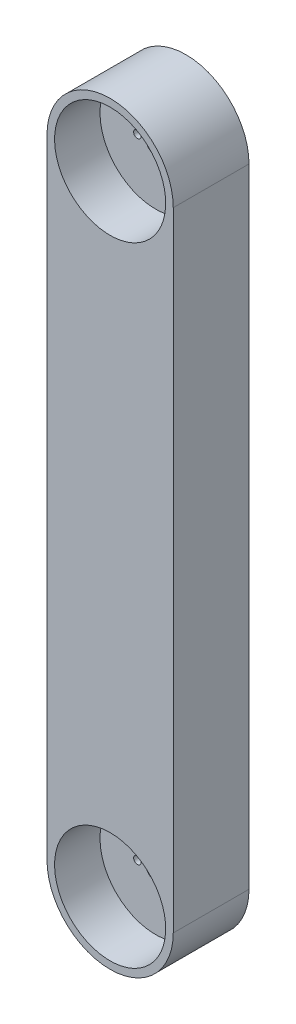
ISO-10303-21;
HEADER;
FILE_DESCRIPTION(('STEP AP214'),'2;1');
FILE_NAME('part.step','',(''),(''),'','','');
FILE_SCHEMA(('AUTOMOTIVE_DESIGN { 1 0 10303 214 1 1 1 1 }'));
ENDSEC;
DATA;
#1=APPLICATION_CONTEXT('core data for automotive mechanical design processes');
#2=APPLICATION_PROTOCOL_DEFINITION('international standard','automotive_design',2000,#1);
#3=PRODUCT_CONTEXT('',#1,'mechanical');
#4=PRODUCT('Part','Part','',(#3));
#5=PRODUCT_RELATED_PRODUCT_CATEGORY('part','',(#4));
#6=PRODUCT_DEFINITION_FORMATION('','',#4);
#7=PRODUCT_DEFINITION_CONTEXT('part definition',#1,'design');
#8=PRODUCT_DEFINITION('design','',#6,#7);
#9=PRODUCT_DEFINITION_SHAPE('','',#8);
#10=(LENGTH_UNIT() NAMED_UNIT(*) SI_UNIT(.MILLI.,.METRE.));
#11=(NAMED_UNIT(*) PLANE_ANGLE_UNIT() SI_UNIT($,.RADIAN.));
#12=(NAMED_UNIT(*) SI_UNIT($,.STERADIAN.) SOLID_ANGLE_UNIT());
#13=UNCERTAINTY_MEASURE_WITH_UNIT(LENGTH_MEASURE(1.E-05),#10,'distance_accuracy_value','');
#14=(GEOMETRIC_REPRESENTATION_CONTEXT(3) GLOBAL_UNCERTAINTY_ASSIGNED_CONTEXT((#13)) GLOBAL_UNIT_ASSIGNED_CONTEXT((#10,
#11,#12)) REPRESENTATION_CONTEXT('',''));
#15=CARTESIAN_POINT('',(0.,0.,0.));
#16=DIRECTION('',(0.,0.,1.));
#17=DIRECTION('',(1.,0.,0.));
#18=AXIS2_PLACEMENT_3D('',#15,#16,#17);
#19=CARTESIAN_POINT('',(0.,28.3690413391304,12.));
#20=DIRECTION('',(0.,0.,1.));
#21=DIRECTION('',(1.,0.,0.));
#22=AXIS2_PLACEMENT_3D('',#19,#20,#21);
#23=CYLINDRICAL_SURFACE('',#22,22.);
#24=CARTESIAN_POINT('',(0.,28.3690413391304,30.));
#25=DIRECTION('',(0.,0.,-1.));
#26=DIRECTION('',(0.,1.,0.));
#27=AXIS2_PLACEMENT_3D('',#24,#25,#26);
#28=CIRCLE('',#27,22.);
#29=CARTESIAN_POINT('',(0.,50.3690413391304,30.));
#30=VERTEX_POINT('',#29);
#31=EDGE_CURVE('E161',#30,#30,#28,.T.);
#32=ORIENTED_EDGE('',*,*,#31,.F.);
#33=EDGE_LOOP('',(#32));
#34=FACE_BOUND('',#33,.T.);
#35=CARTESIAN_POINT('',(0.,28.3690413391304,12.));
#36=DIRECTION('',(0.,0.,-1.));
#37=DIRECTION('',(0.,1.,0.));
#38=AXIS2_PLACEMENT_3D('',#35,#36,#37);
#39=CIRCLE('',#38,22.);
#40=CARTESIAN_POINT('',(0.,50.3690413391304,12.));
#41=VERTEX_POINT('',#40);
#42=EDGE_CURVE('E10',#41,#41,#39,.T.);
#43=ORIENTED_EDGE('',*,*,#42,.T.);
#44=EDGE_LOOP('',(#43));
#45=FACE_BOUND('',#44,.T.);
#46=ADVANCED_FACE('F16',(#34,#45),#23,.F.);
#47=CARTESIAN_POINT('',(0.,28.3690413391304,12.));
#48=DIRECTION('',(0.,0.,-1.));
#49=DIRECTION('',(0.,-1.,0.));
#50=AXIS2_PLACEMENT_3D('',#47,#48,#49);
#51=PLANE('',#50);
#52=CARTESIAN_POINT('',(0.,28.4431326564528,12.));
#53=DIRECTION('',(0.,0.,1.));
#54=DIRECTION('',(-1.,0.,0.));
#55=AXIS2_PLACEMENT_3D('',#52,#53,#54);
#56=CIRCLE('',#55,3.75);
#57=CARTESIAN_POINT('',(-3.75,28.4431326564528,12.));
#58=VERTEX_POINT('',#57);
#59=EDGE_CURVE('E210',#58,#58,#56,.T.);
#60=ORIENTED_EDGE('',*,*,#59,.F.);
#61=EDGE_LOOP('',(#60));
#62=FACE_BOUND('',#61,.T.);
#63=ORIENTED_EDGE('',*,*,#42,.F.);
#64=EDGE_LOOP('',(#63));
#65=FACE_BOUND('',#64,.T.);
#66=CARTESIAN_POINT('',(-7.2,28.4842972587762,12.));
#67=DIRECTION('',(0.,0.,-1.));
#68=DIRECTION('',(-1.,0.,0.));
#69=AXIS2_PLACEMENT_3D('',#66,#67,#68);
#70=CIRCLE('',#69,1.5);
#71=CARTESIAN_POINT('',(-8.7,28.4842972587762,12.));
#72=VERTEX_POINT('',#71);
#73=EDGE_CURVE('E219',#72,#72,#70,.T.);
#74=ORIENTED_EDGE('',*,*,#73,.T.);
#75=EDGE_LOOP('',(#74));
#76=FACE_BOUND('',#75,.T.);
#77=CARTESIAN_POINT('',(7.2,28.4842972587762,12.));
#78=DIRECTION('',(0.,0.,1.));
#79=DIRECTION('',(-1.,0.,0.));
#80=AXIS2_PLACEMENT_3D('',#77,#78,#79);
#81=CIRCLE('',#80,1.5);
#82=CARTESIAN_POINT('',(5.7,28.4842972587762,12.));
#83=VERTEX_POINT('',#82);
#84=EDGE_CURVE('E220',#83,#83,#81,.T.);
#85=ORIENTED_EDGE('',*,*,#84,.F.);
#86=EDGE_LOOP('',(#85));
#87=FACE_BOUND('',#86,.T.);
#88=ADVANCED_FACE('F298',(#62,#65,#76,#87),#51,.F.);
#89=CARTESIAN_POINT('',(0.,-220.429632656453,12.));
#90=DIRECTION('',(0.,0.,1.));
#91=DIRECTION('',(1.,0.,0.));
#92=AXIS2_PLACEMENT_3D('',#89,#90,#91);
#93=CYLINDRICAL_SURFACE('',#92,22.);
#94=CARTESIAN_POINT('',(0.,-220.429632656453,30.));
#95=DIRECTION('',(0.,0.,-1.));
#96=DIRECTION('',(0.,1.,0.));
#97=AXIS2_PLACEMENT_3D('',#94,#95,#96);
#98=CIRCLE('',#97,22.);
#99=CARTESIAN_POINT('',(0.,-198.429632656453,30.));
#100=VERTEX_POINT('',#99);
#101=EDGE_CURVE('E204',#100,#100,#98,.T.);
#102=ORIENTED_EDGE('',*,*,#101,.F.);
#103=EDGE_LOOP('',(#102));
#104=FACE_BOUND('',#103,.T.);
#105=CARTESIAN_POINT('',(0.,-220.429632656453,12.));
#106=DIRECTION('',(0.,0.,-1.));
#107=DIRECTION('',(0.,1.,0.));
#108=AXIS2_PLACEMENT_3D('',#105,#106,#107);
#109=CIRCLE('',#108,22.);
#110=CARTESIAN_POINT('',(0.,-198.429632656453,12.));
#111=VERTEX_POINT('',#110);
#112=EDGE_CURVE('E27',#111,#111,#109,.T.);
#113=ORIENTED_EDGE('',*,*,#112,.T.);
#114=EDGE_LOOP('',(#113));
#115=FACE_BOUND('',#114,.T.);
#116=ADVANCED_FACE('F256',(#104,#115),#93,.F.);
#117=CARTESIAN_POINT('',(0.,-220.429632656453,12.));
#118=DIRECTION('',(0.,0.,-1.));
#119=DIRECTION('',(0.,-1.,0.));
#120=AXIS2_PLACEMENT_3D('',#117,#118,#119);
#121=PLANE('',#120);
#122=CARTESIAN_POINT('',(-7.2,-220.470797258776,12.));
#123=DIRECTION('',(0.,0.,1.));
#124=DIRECTION('',(-1.,0.,0.));
#125=AXIS2_PLACEMENT_3D('',#122,#123,#124);
#126=CIRCLE('',#125,1.5);
#127=CARTESIAN_POINT('',(-8.7,-220.470797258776,12.));
#128=VERTEX_POINT('',#127);
#129=EDGE_CURVE('E235',#128,#128,#126,.T.);
#130=ORIENTED_EDGE('',*,*,#129,.F.);
#131=EDGE_LOOP('',(#130));
#132=FACE_BOUND('',#131,.T.);
#133=ORIENTED_EDGE('',*,*,#112,.F.);
#134=EDGE_LOOP('',(#133));
#135=FACE_BOUND('',#134,.T.);
#136=CARTESIAN_POINT('',(7.2,-220.470797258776,12.));
#137=DIRECTION('',(0.,0.,-1.));
#138=DIRECTION('',(-1.,0.,0.));
#139=AXIS2_PLACEMENT_3D('',#136,#137,#138);
#140=CIRCLE('',#139,1.5);
#141=CARTESIAN_POINT('',(5.7,-220.470797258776,12.));
#142=VERTEX_POINT('',#141);
#143=EDGE_CURVE('E199',#142,#142,#140,.T.);
#144=ORIENTED_EDGE('',*,*,#143,.T.);
#145=EDGE_LOOP('',(#144));
#146=FACE_BOUND('',#145,.T.);
#147=CARTESIAN_POINT('',(0.,-220.429632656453,12.));
#148=DIRECTION('',(0.,0.,-1.));
#149=DIRECTION('',(-1.,0.,0.));
#150=AXIS2_PLACEMENT_3D('',#147,#148,#149);
#151=CIRCLE('',#150,3.75);
#152=CARTESIAN_POINT('',(-3.75,-220.429632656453,12.));
#153=VERTEX_POINT('',#152);
#154=EDGE_CURVE('E227',#153,#153,#151,.T.);
#155=ORIENTED_EDGE('',*,*,#154,.T.);
#156=EDGE_LOOP('',(#155));
#157=FACE_BOUND('',#156,.T.);
#158=ADVANCED_FACE('F252',(#132,#135,#146,#157),#121,.F.);
#159=CARTESIAN_POINT('',(0.,28.4842972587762,6.));
#160=DIRECTION('',(0.,0.,-1.));
#161=DIRECTION('',(-1.,0.,0.));
#162=AXIS2_PLACEMENT_3D('',#159,#160,#161);
#163=CYLINDRICAL_SURFACE('',#162,12.5);
#164=CARTESIAN_POINT('',(0.,28.4842972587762,0.));
#165=DIRECTION('',(0.,0.,1.));
#166=DIRECTION('',(0.,1.,0.));
#167=AXIS2_PLACEMENT_3D('',#164,#165,#166);
#168=CIRCLE('',#167,12.5);
#169=CARTESIAN_POINT('',(0.,40.9842972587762,0.));
#170=VERTEX_POINT('',#169);
#171=EDGE_CURVE('E194',#170,#170,#168,.T.);
#172=ORIENTED_EDGE('',*,*,#171,.F.);
#173=EDGE_LOOP('',(#172));
#174=FACE_BOUND('',#173,.T.);
#175=CARTESIAN_POINT('',(0.,28.4842972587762,6.));
#176=DIRECTION('',(0.,0.,1.));
#177=DIRECTION('',(0.,1.,0.));
#178=AXIS2_PLACEMENT_3D('',#175,#176,#177);
#179=CIRCLE('',#178,12.5);
#180=CARTESIAN_POINT('',(0.,40.9842972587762,6.));
#181=VERTEX_POINT('',#180);
#182=EDGE_CURVE('E198',#181,#181,#179,.T.);
#183=ORIENTED_EDGE('',*,*,#182,.T.);
#184=EDGE_LOOP('',(#183));
#185=FACE_BOUND('',#184,.T.);
#186=ADVANCED_FACE('F255',(#174,#185),#163,.F.);
#187=CARTESIAN_POINT('',(0.,28.4842972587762,6.));
#188=DIRECTION('',(0.,0.,1.));
#189=DIRECTION('',(1.,0.,0.));
#190=AXIS2_PLACEMENT_3D('',#187,#188,#189);
#191=PLANE('',#190);
#192=CARTESIAN_POINT('',(0.,28.4431326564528,6.));
#193=DIRECTION('',(0.,0.,-1.));
#194=DIRECTION('',(1.,0.,0.));
#195=AXIS2_PLACEMENT_3D('',#192,#193,#194);
#196=CIRCLE('',#195,3.75);
#197=CARTESIAN_POINT('',(3.75,28.4431326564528,6.));
#198=VERTEX_POINT('',#197);
#199=EDGE_CURVE('E213',#198,#198,#196,.T.);
#200=ORIENTED_EDGE('',*,*,#199,.F.);
#201=EDGE_LOOP('',(#200));
#202=FACE_BOUND('',#201,.T.);
#203=ORIENTED_EDGE('',*,*,#182,.F.);
#204=EDGE_LOOP('',(#203));
#205=FACE_BOUND('',#204,.T.);
#206=CARTESIAN_POINT('',(-7.2,28.4842972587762,6.));
#207=DIRECTION('',(0.,0.,1.));
#208=DIRECTION('',(1.,0.,0.));
#209=AXIS2_PLACEMENT_3D('',#206,#207,#208);
#210=CIRCLE('',#209,1.5);
#211=CARTESIAN_POINT('',(-5.7,28.4842972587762,6.));
#212=VERTEX_POINT('',#211);
#213=EDGE_CURVE('E228',#212,#212,#210,.T.);
#214=ORIENTED_EDGE('',*,*,#213,.T.);
#215=EDGE_LOOP('',(#214));
#216=FACE_BOUND('',#215,.T.);
#217=CARTESIAN_POINT('',(7.2,28.4842972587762,6.));
#218=DIRECTION('',(0.,0.,-1.));
#219=DIRECTION('',(1.,0.,0.));
#220=AXIS2_PLACEMENT_3D('',#217,#218,#219);
#221=CIRCLE('',#220,1.5);
#222=CARTESIAN_POINT('',(8.7,28.4842972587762,6.));
#223=VERTEX_POINT('',#222);
#224=EDGE_CURVE('E215',#223,#223,#221,.T.);
#225=ORIENTED_EDGE('',*,*,#224,.F.);
#226=EDGE_LOOP('',(#225));
#227=FACE_BOUND('',#226,.T.);
#228=ADVANCED_FACE('F312',(#202,#205,#216,#227),#191,.F.);
#229=CARTESIAN_POINT('',(0.,-220.429632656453,6.));
#230=DIRECTION('',(0.,0.,-1.));
#231=DIRECTION('',(-1.,0.,0.));
#232=AXIS2_PLACEMENT_3D('',#229,#230,#231);
#233=CYLINDRICAL_SURFACE('',#232,12.5);
#234=CARTESIAN_POINT('',(0.,-220.429632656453,0.));
#235=DIRECTION('',(0.,0.,1.));
#236=DIRECTION('',(0.,1.,0.));
#237=AXIS2_PLACEMENT_3D('',#234,#235,#236);
#238=CIRCLE('',#237,12.5);
#239=CARTESIAN_POINT('',(0.,-207.929632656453,0.));
#240=VERTEX_POINT('',#239);
#241=EDGE_CURVE('E190',#240,#240,#238,.T.);
#242=ORIENTED_EDGE('',*,*,#241,.F.);
#243=EDGE_LOOP('',(#242));
#244=FACE_BOUND('',#243,.T.);
#245=CARTESIAN_POINT('',(0.,-220.429632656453,6.));
#246=DIRECTION('',(0.,0.,1.));
#247=DIRECTION('',(0.,1.,0.));
#248=AXIS2_PLACEMENT_3D('',#245,#246,#247);
#249=CIRCLE('',#248,12.5);
#250=CARTESIAN_POINT('',(0.,-207.929632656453,6.));
#251=VERTEX_POINT('',#250);
#252=EDGE_CURVE('E193',#251,#251,#249,.T.);
#253=ORIENTED_EDGE('',*,*,#252,.T.);
#254=EDGE_LOOP('',(#253));
#255=FACE_BOUND('',#254,.T.);
#256=ADVANCED_FACE('F309',(#244,#255),#233,.F.);
#257=CARTESIAN_POINT('',(0.,-220.429632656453,6.));
#258=DIRECTION('',(0.,0.,1.));
#259=DIRECTION('',(1.,0.,0.));
#260=AXIS2_PLACEMENT_3D('',#257,#258,#259);
#261=PLANE('',#260);
#262=CARTESIAN_POINT('',(-7.2,-220.470797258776,6.));
#263=DIRECTION('',(0.,0.,-1.));
#264=DIRECTION('',(1.,0.,0.));
#265=AXIS2_PLACEMENT_3D('',#262,#263,#264);
#266=CIRCLE('',#265,1.5);
#267=CARTESIAN_POINT('',(-5.7,-220.470797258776,6.));
#268=VERTEX_POINT('',#267);
#269=EDGE_CURVE('E137',#268,#268,#266,.T.);
#270=ORIENTED_EDGE('',*,*,#269,.F.);
#271=EDGE_LOOP('',(#270));
#272=FACE_BOUND('',#271,.T.);
#273=ORIENTED_EDGE('',*,*,#252,.F.);
#274=EDGE_LOOP('',(#273));
#275=FACE_BOUND('',#274,.T.);
#276=CARTESIAN_POINT('',(7.2,-220.470797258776,6.));
#277=DIRECTION('',(0.,0.,1.));
#278=DIRECTION('',(1.,0.,0.));
#279=AXIS2_PLACEMENT_3D('',#276,#277,#278);
#280=CIRCLE('',#279,1.5);
#281=CARTESIAN_POINT('',(8.7,-220.470797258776,6.));
#282=VERTEX_POINT('',#281);
#283=EDGE_CURVE('E201',#282,#282,#280,.T.);
#284=ORIENTED_EDGE('',*,*,#283,.T.);
#285=EDGE_LOOP('',(#284));
#286=FACE_BOUND('',#285,.T.);
#287=CARTESIAN_POINT('',(0.,-220.429632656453,6.));
#288=DIRECTION('',(0.,0.,1.));
#289=DIRECTION('',(1.,0.,0.));
#290=AXIS2_PLACEMENT_3D('',#287,#288,#289);
#291=CIRCLE('',#290,3.75);
#292=CARTESIAN_POINT('',(3.75,-220.429632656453,6.));
#293=VERTEX_POINT('',#292);
#294=EDGE_CURVE('E202',#293,#293,#291,.T.);
#295=ORIENTED_EDGE('',*,*,#294,.T.);
#296=EDGE_LOOP('',(#295));
#297=FACE_BOUND('',#296,.T.);
#298=ADVANCED_FACE('F242',(#272,#275,#286,#297),#261,.F.);
#299=CARTESIAN_POINT('',(0.,28.3690413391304,0.));
#300=DIRECTION('',(0.,0.,1.));
#301=DIRECTION('',(1.,0.,0.));
#302=AXIS2_PLACEMENT_3D('',#299,#300,#301);
#303=PLANE('',#302);
#304=CARTESIAN_POINT('',(0.,28.3690413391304,0.));
#305=DIRECTION('',(0.,0.,1.));
#306=DIRECTION('',(1.,0.,0.));
#307=AXIS2_PLACEMENT_3D('',#304,#305,#306);
#308=CIRCLE('',#307,25.);
#309=CARTESIAN_POINT('',(25.,28.3690413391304,0.));
#310=VERTEX_POINT('',#309);
#311=CARTESIAN_POINT('',(-25.,28.3690413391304,0.));
#312=VERTEX_POINT('',#311);
#313=EDGE_CURVE('E143',#310,#312,#308,.T.);
#314=ORIENTED_EDGE('',*,*,#313,.F.);
#315=DIRECTION('',(0.,1.,0.));
#316=VECTOR('',#315,1.);
#317=CARTESIAN_POINT('',(25.,28.3690413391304,0.));
#318=LINE('',#317,#316);
#319=CARTESIAN_POINT('',(25.,-220.35554133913,0.));
#320=VERTEX_POINT('',#319);
#321=EDGE_CURVE('E125',#320,#310,#318,.T.);
#322=ORIENTED_EDGE('',*,*,#321,.F.);
#323=CARTESIAN_POINT('',(0.,-220.35554133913,0.));
#324=DIRECTION('',(0.,0.,1.));
#325=DIRECTION('',(-1.,0.,0.));
#326=AXIS2_PLACEMENT_3D('',#323,#324,#325);
#327=CIRCLE('',#326,25.);
#328=CARTESIAN_POINT('',(-25.,-220.35554133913,0.));
#329=VERTEX_POINT('',#328);
#330=EDGE_CURVE('E168',#329,#320,#327,.T.);
#331=ORIENTED_EDGE('',*,*,#330,.F.);
#332=DIRECTION('',(0.,-1.,0.));
#333=VECTOR('',#332,1.);
#334=CARTESIAN_POINT('',(-25.,28.3690413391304,0.));
#335=LINE('',#334,#333);
#336=EDGE_CURVE('E20',#312,#329,#335,.T.);
#337=ORIENTED_EDGE('',*,*,#336,.F.);
#338=EDGE_LOOP('',(#314,#322,#331,#337));
#339=FACE_BOUND('',#338,.T.);
#340=ORIENTED_EDGE('',*,*,#241,.T.);
#341=EDGE_LOOP('',(#340));
#342=FACE_BOUND('',#341,.T.);
#343=ORIENTED_EDGE('',*,*,#171,.T.);
#344=EDGE_LOOP('',(#343));
#345=FACE_BOUND('',#344,.T.);
#346=ADVANCED_FACE('F147',(#339,#342,#345),#303,.F.);
#347=CARTESIAN_POINT('',(0.,28.3690413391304,30.));
#348=DIRECTION('',(0.,0.,1.));
#349=DIRECTION('',(1.,0.,0.));
#350=AXIS2_PLACEMENT_3D('',#347,#348,#349);
#351=PLANE('',#350);
#352=CARTESIAN_POINT('',(0.,28.3690413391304,30.));
#353=DIRECTION('',(0.,0.,1.));
#354=DIRECTION('',(1.,0.,0.));
#355=AXIS2_PLACEMENT_3D('',#352,#353,#354);
#356=CIRCLE('',#355,25.);
#357=CARTESIAN_POINT('',(25.,28.3690413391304,30.));
#358=VERTEX_POINT('',#357);
#359=CARTESIAN_POINT('',(-25.,28.3690413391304,30.));
#360=VERTEX_POINT('',#359);
#361=EDGE_CURVE('E145',#358,#360,#356,.T.);
#362=ORIENTED_EDGE('',*,*,#361,.T.);
#363=DIRECTION('',(0.,-1.,0.));
#364=VECTOR('',#363,1.);
#365=CARTESIAN_POINT('',(-25.,28.3690413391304,30.));
#366=LINE('',#365,#364);
#367=CARTESIAN_POINT('',(-25.,-220.35554133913,30.));
#368=VERTEX_POINT('',#367);
#369=EDGE_CURVE('E165',#360,#368,#366,.T.);
#370=ORIENTED_EDGE('',*,*,#369,.T.);
#371=CARTESIAN_POINT('',(0.,-220.35554133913,30.));
#372=DIRECTION('',(0.,0.,1.));
#373=DIRECTION('',(-1.,0.,0.));
#374=AXIS2_PLACEMENT_3D('',#371,#372,#373);
#375=CIRCLE('',#374,25.);
#376=CARTESIAN_POINT('',(25.,-220.35554133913,30.));
#377=VERTEX_POINT('',#376);
#378=EDGE_CURVE('E214',#368,#377,#375,.T.);
#379=ORIENTED_EDGE('',*,*,#378,.T.);
#380=DIRECTION('',(0.,1.,0.));
#381=VECTOR('',#380,1.);
#382=CARTESIAN_POINT('',(25.,28.3690413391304,30.));
#383=LINE('',#382,#381);
#384=EDGE_CURVE('E136',#377,#358,#383,.T.);
#385=ORIENTED_EDGE('',*,*,#384,.T.);
#386=EDGE_LOOP('',(#362,#370,#379,#385));
#387=FACE_BOUND('',#386,.T.);
#388=ORIENTED_EDGE('',*,*,#101,.T.);
#389=EDGE_LOOP('',(#388));
#390=FACE_BOUND('',#389,.T.);
#391=ORIENTED_EDGE('',*,*,#31,.T.);
#392=EDGE_LOOP('',(#391));
#393=FACE_BOUND('',#392,.T.);
#394=ADVANCED_FACE('F279',(#387,#390,#393),#351,.T.);
#395=CARTESIAN_POINT('',(25.,28.3690413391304,30.));
#396=DIRECTION('',(-1.,0.,0.));
#397=DIRECTION('',(0.,1.,0.));
#398=AXIS2_PLACEMENT_3D('',#395,#396,#397);
#399=PLANE('',#398);
#400=ORIENTED_EDGE('',*,*,#321,.T.);
#401=DIRECTION('',(0.,0.,-1.));
#402=VECTOR('',#401,1.);
#403=CARTESIAN_POINT('',(25.,28.3690413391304,30.));
#404=LINE('',#403,#402);
#405=EDGE_CURVE('E128',#358,#310,#404,.T.);
#406=ORIENTED_EDGE('',*,*,#405,.F.);
#407=ORIENTED_EDGE('',*,*,#384,.F.);
#408=DIRECTION('',(0.,0.,-1.));
#409=VECTOR('',#408,1.);
#410=CARTESIAN_POINT('',(25.,-220.35554133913,30.));
#411=LINE('',#410,#409);
#412=EDGE_CURVE('E131',#377,#320,#411,.T.);
#413=ORIENTED_EDGE('',*,*,#412,.T.);
#414=EDGE_LOOP('',(#400,#406,#407,#413));
#415=FACE_BOUND('',#414,.T.);
#416=ADVANCED_FACE('F127',(#415),#399,.F.);
#417=CARTESIAN_POINT('',(-7.2,-220.470797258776,30.));
#418=DIRECTION('',(0.,0.,-1.));
#419=DIRECTION('',(-1.,0.,0.));
#420=AXIS2_PLACEMENT_3D('',#417,#418,#419);
#421=CYLINDRICAL_SURFACE('',#420,1.5);
#422=ORIENTED_EDGE('',*,*,#269,.T.);
#423=EDGE_LOOP('',(#422));
#424=FACE_BOUND('',#423,.T.);
#425=ORIENTED_EDGE('',*,*,#129,.T.);
#426=EDGE_LOOP('',(#425));
#427=FACE_BOUND('',#426,.T.);
#428=ADVANCED_FACE('F18',(#424,#427),#421,.F.);
#429=CARTESIAN_POINT('',(7.2,-220.470797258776,30.));
#430=DIRECTION('',(0.,0.,-1.));
#431=DIRECTION('',(-1.,0.,0.));
#432=AXIS2_PLACEMENT_3D('',#429,#430,#431);
#433=CYLINDRICAL_SURFACE('',#432,1.5);
#434=ORIENTED_EDGE('',*,*,#283,.F.);
#435=EDGE_LOOP('',(#434));
#436=FACE_BOUND('',#435,.T.);
#437=ORIENTED_EDGE('',*,*,#143,.F.);
#438=EDGE_LOOP('',(#437));
#439=FACE_BOUND('',#438,.T.);
#440=ADVANCED_FACE('F245',(#436,#439),#433,.F.);
#441=CARTESIAN_POINT('',(0.,-220.429632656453,30.));
#442=DIRECTION('',(0.,0.,-1.));
#443=DIRECTION('',(-1.,0.,0.));
#444=AXIS2_PLACEMENT_3D('',#441,#442,#443);
#445=CYLINDRICAL_SURFACE('',#444,3.75);
#446=ORIENTED_EDGE('',*,*,#294,.F.);
#447=EDGE_LOOP('',(#446));
#448=FACE_BOUND('',#447,.T.);
#449=ORIENTED_EDGE('',*,*,#154,.F.);
#450=EDGE_LOOP('',(#449));
#451=FACE_BOUND('',#450,.T.);
#452=ADVANCED_FACE('F248',(#448,#451),#445,.F.);
#453=CARTESIAN_POINT('',(-7.2,28.4842972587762,30.));
#454=DIRECTION('',(0.,0.,-1.));
#455=DIRECTION('',(-1.,0.,0.));
#456=AXIS2_PLACEMENT_3D('',#453,#454,#455);
#457=CYLINDRICAL_SURFACE('',#456,1.5);
#458=ORIENTED_EDGE('',*,*,#213,.F.);
#459=EDGE_LOOP('',(#458));
#460=FACE_BOUND('',#459,.T.);
#461=ORIENTED_EDGE('',*,*,#73,.F.);
#462=EDGE_LOOP('',(#461));
#463=FACE_BOUND('',#462,.T.);
#464=ADVANCED_FACE('F332',(#460,#463),#457,.F.);
#465=CARTESIAN_POINT('',(7.2,28.4842972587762,30.));
#466=DIRECTION('',(0.,0.,-1.));
#467=DIRECTION('',(-1.,0.,0.));
#468=AXIS2_PLACEMENT_3D('',#465,#466,#467);
#469=CYLINDRICAL_SURFACE('',#468,1.5);
#470=ORIENTED_EDGE('',*,*,#224,.T.);
#471=EDGE_LOOP('',(#470));
#472=FACE_BOUND('',#471,.T.);
#473=ORIENTED_EDGE('',*,*,#84,.T.);
#474=EDGE_LOOP('',(#473));
#475=FACE_BOUND('',#474,.T.);
#476=ADVANCED_FACE('F293',(#472,#475),#469,.F.);
#477=CARTESIAN_POINT('',(0.,28.4431326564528,30.));
#478=DIRECTION('',(0.,0.,-1.));
#479=DIRECTION('',(-1.,0.,0.));
#480=AXIS2_PLACEMENT_3D('',#477,#478,#479);
#481=CYLINDRICAL_SURFACE('',#480,3.75);
#482=ORIENTED_EDGE('',*,*,#199,.T.);
#483=EDGE_LOOP('',(#482));
#484=FACE_BOUND('',#483,.T.);
#485=ORIENTED_EDGE('',*,*,#59,.T.);
#486=EDGE_LOOP('',(#485));
#487=FACE_BOUND('',#486,.T.);
#488=ADVANCED_FACE('F284',(#484,#487),#481,.F.);
#489=CARTESIAN_POINT('',(0.,-220.35554133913,30.));
#490=DIRECTION('',(0.,0.,-1.));
#491=DIRECTION('',(-1.,0.,0.));
#492=AXIS2_PLACEMENT_3D('',#489,#490,#491);
#493=CYLINDRICAL_SURFACE('',#492,25.);
#494=ORIENTED_EDGE('',*,*,#330,.T.);
#495=ORIENTED_EDGE('',*,*,#412,.F.);
#496=ORIENTED_EDGE('',*,*,#378,.F.);
#497=DIRECTION('',(0.,0.,-1.));
#498=VECTOR('',#497,1.);
#499=CARTESIAN_POINT('',(-25.,-220.35554133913,30.));
#500=LINE('',#499,#498);
#501=EDGE_CURVE('E169',#368,#329,#500,.T.);
#502=ORIENTED_EDGE('',*,*,#501,.T.);
#503=EDGE_LOOP('',(#494,#495,#496,#502));
#504=FACE_BOUND('',#503,.T.);
#505=ADVANCED_FACE('F281',(#504),#493,.T.);
#506=CARTESIAN_POINT('',(-25.,28.3690413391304,30.));
#507=DIRECTION('',(1.,0.,0.));
#508=DIRECTION('',(0.,1.,0.));
#509=AXIS2_PLACEMENT_3D('',#506,#507,#508);
#510=PLANE('',#509);
#511=ORIENTED_EDGE('',*,*,#336,.T.);
#512=ORIENTED_EDGE('',*,*,#501,.F.);
#513=ORIENTED_EDGE('',*,*,#369,.F.);
#514=DIRECTION('',(0.,0.,-1.));
#515=VECTOR('',#514,1.);
#516=CARTESIAN_POINT('',(-25.,28.3690413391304,30.));
#517=LINE('',#516,#515);
#518=EDGE_CURVE('E152',#360,#312,#517,.T.);
#519=ORIENTED_EDGE('',*,*,#518,.T.);
#520=EDGE_LOOP('',(#511,#512,#513,#519));
#521=FACE_BOUND('',#520,.T.);
#522=ADVANCED_FACE('F283',(#521),#510,.F.);
#523=CARTESIAN_POINT('',(0.,28.3690413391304,30.));
#524=DIRECTION('',(0.,0.,-1.));
#525=DIRECTION('',(-1.,0.,0.));
#526=AXIS2_PLACEMENT_3D('',#523,#524,#525);
#527=CYLINDRICAL_SURFACE('',#526,25.);
#528=ORIENTED_EDGE('',*,*,#313,.T.);
#529=ORIENTED_EDGE('',*,*,#518,.F.);
#530=ORIENTED_EDGE('',*,*,#361,.F.);
#531=ORIENTED_EDGE('',*,*,#405,.T.);
#532=EDGE_LOOP('',(#528,#529,#530,#531));
#533=FACE_BOUND('',#532,.T.);
#534=ADVANCED_FACE('F141',(#533),#527,.T.);
#535=CLOSED_SHELL('',(#46,#88,#116,#158,#186,#228,#256,#298,#346,#394,#416,#428,#440,#452,#464,
#476,#488,#505,#522,#534));
#536=MANIFOLD_SOLID_BREP('B1',#535);
#537=ADVANCED_BREP_SHAPE_REPRESENTATION('',(#18,#536),#14);
#538=SHAPE_DEFINITION_REPRESENTATION(#9,#537);
ENDSEC;
END-ISO-10303-21;
